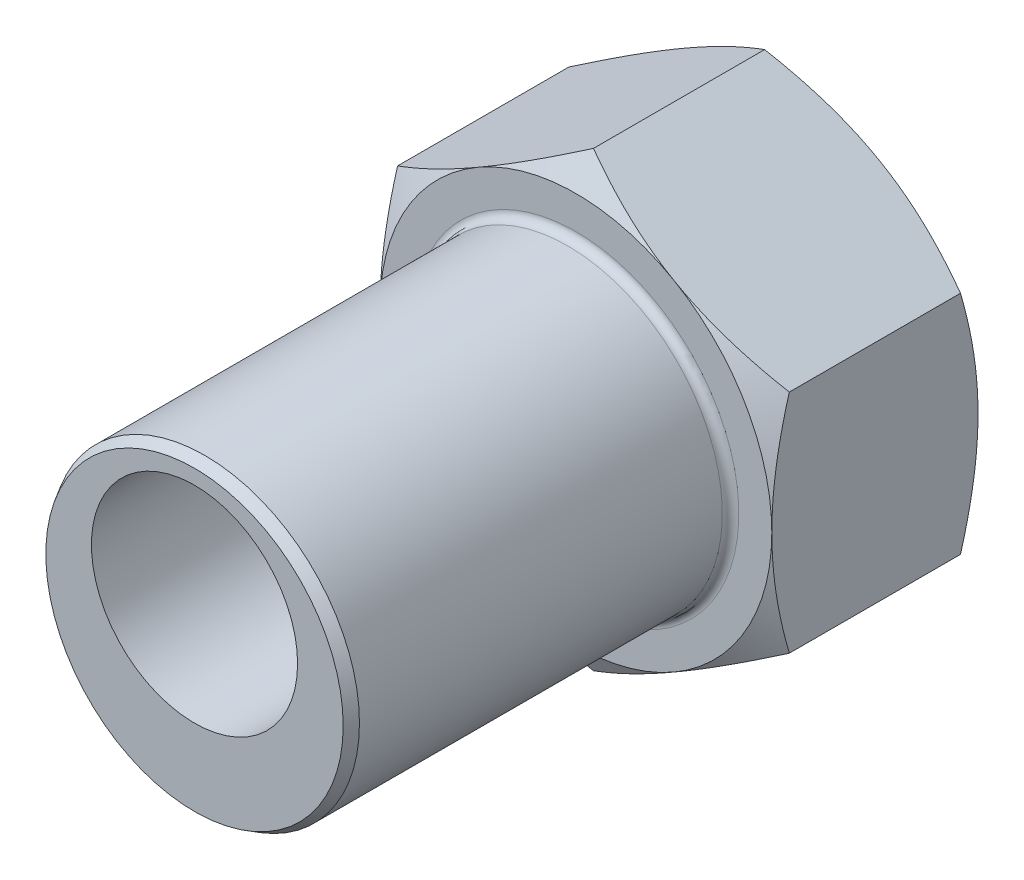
ISO-10303-21;
HEADER;
FILE_DESCRIPTION(('STEP AP214'),'2;1');
FILE_NAME('part.step','',(''),(''),'','','');
FILE_SCHEMA(('AUTOMOTIVE_DESIGN { 1 0 10303 214 1 1 1 1 }'));
ENDSEC;
DATA;
#1=APPLICATION_CONTEXT('core data for automotive mechanical design processes');
#2=APPLICATION_PROTOCOL_DEFINITION('international standard','automotive_design',2000,#1);
#3=PRODUCT_CONTEXT('',#1,'mechanical');
#4=PRODUCT('Part','Part','',(#3));
#5=PRODUCT_RELATED_PRODUCT_CATEGORY('part','',(#4));
#6=PRODUCT_DEFINITION_FORMATION('','',#4);
#7=PRODUCT_DEFINITION_CONTEXT('part definition',#1,'design');
#8=PRODUCT_DEFINITION('design','',#6,#7);
#9=PRODUCT_DEFINITION_SHAPE('','',#8);
#10=(LENGTH_UNIT() NAMED_UNIT(*) SI_UNIT(.MILLI.,.METRE.));
#11=(NAMED_UNIT(*) PLANE_ANGLE_UNIT() SI_UNIT($,.RADIAN.));
#12=(NAMED_UNIT(*) SI_UNIT($,.STERADIAN.) SOLID_ANGLE_UNIT());
#13=UNCERTAINTY_MEASURE_WITH_UNIT(LENGTH_MEASURE(1.E-05),#10,'distance_accuracy_value','');
#14=(GEOMETRIC_REPRESENTATION_CONTEXT(3) GLOBAL_UNCERTAINTY_ASSIGNED_CONTEXT((#13)) GLOBAL_UNIT_ASSIGNED_CONTEXT((#10,
#11,#12)) REPRESENTATION_CONTEXT('',''));
#15=CARTESIAN_POINT('',(0.,0.,0.));
#16=DIRECTION('',(0.,0.,1.));
#17=DIRECTION('',(1.,0.,0.));
#18=AXIS2_PLACEMENT_3D('',#15,#16,#17);
#19=CARTESIAN_POINT('',(0.,9.4696551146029,10.));
#20=DIRECTION('',(0.,0.,-1.));
#21=DIRECTION('',(-1.,0.,0.));
#22=AXIS2_PLACEMENT_3D('',#19,#20,#21);
#23=PLANE('',#22);
#24=CARTESIAN_POINT('',(0.,-1.5,10.));
#25=DIRECTION('',(0.,0.,-1.));
#26=DIRECTION('',(-1.,0.,0.));
#27=AXIS2_PLACEMENT_3D('',#24,#25,#26);
#28=CIRCLE('',#27,7.9);
#29=CARTESIAN_POINT('',(-7.9,-1.5,10.));
#30=VERTEX_POINT('',#29);
#31=EDGE_CURVE('E283',#30,#30,#28,.T.);
#32=ORIENTED_EDGE('',*,*,#31,.T.);
#33=EDGE_LOOP('',(#32));
#34=FACE_BOUND('',#33,.T.);
#35=CARTESIAN_POINT('',(0.,-1.5,10.));
#36=DIRECTION('',(0.,0.,1.));
#37=DIRECTION('',(1.,0.,0.));
#38=AXIS2_PLACEMENT_3D('',#35,#36,#37);
#39=CIRCLE('',#38,9.5);
#40=CARTESIAN_POINT('',(-4.75,6.72724133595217,10.));
#41=VERTEX_POINT('',#40);
#42=CARTESIAN_POINT('',(-9.5,-1.5,10.));
#43=VERTEX_POINT('',#42);
#44=EDGE_CURVE('E331',#41,#43,#39,.T.);
#45=ORIENTED_EDGE('',*,*,#44,.T.);
#46=CARTESIAN_POINT('',(-4.75,-9.72724133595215,10.));
#47=VERTEX_POINT('',#46);
#48=EDGE_CURVE('E327',#43,#47,#39,.T.);
#49=ORIENTED_EDGE('',*,*,#48,.T.);
#50=CARTESIAN_POINT('',(4.75,-9.72724133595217,10.));
#51=VERTEX_POINT('',#50);
#52=EDGE_CURVE('E324',#47,#51,#39,.T.);
#53=ORIENTED_EDGE('',*,*,#52,.T.);
#54=CARTESIAN_POINT('',(9.5,-1.5,10.));
#55=VERTEX_POINT('',#54);
#56=EDGE_CURVE('E322',#51,#55,#39,.T.);
#57=ORIENTED_EDGE('',*,*,#56,.T.);
#58=CARTESIAN_POINT('',(4.75,6.72724133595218,10.));
#59=VERTEX_POINT('',#58);
#60=EDGE_CURVE('E325',#55,#59,#39,.T.);
#61=ORIENTED_EDGE('',*,*,#60,.T.);
#62=EDGE_CURVE('E328',#59,#41,#39,.T.);
#63=ORIENTED_EDGE('',*,*,#62,.T.);
#64=EDGE_LOOP('',(#45,#49,#53,#57,#61,#63));
#65=FACE_BOUND('',#64,.T.);
#66=ADVANCED_FACE('F14',(#34,#65),#23,.F.);
#67=CARTESIAN_POINT('',(-9.5,3.98482755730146,10.));
#68=DIRECTION('',(-0.5,0.866025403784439,0.));
#69=DIRECTION('',(0.866025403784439,0.5,0.));
#70=AXIS2_PLACEMENT_3D('',#67,#68,#69);
#71=PLANE('',#70);
#72=CARTESIAN_POINT('',(-9.5002,3.98471208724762,0.84857244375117));
#73=CARTESIAN_POINT('',(-9.2913692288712,4.10528058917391,0.77897343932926));
#74=CARTESIAN_POINT('',(-9.08175982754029,4.22629863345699,0.71253330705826));
#75=CARTESIAN_POINT('',(-8.66086011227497,4.46930519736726,0.586847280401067));
#76=CARTESIAN_POINT('',(-8.44956926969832,4.59129402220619,0.527603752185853));
#77=CARTESIAN_POINT('',(-7.81229220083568,4.95922610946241,0.361814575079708));
#78=CARTESIAN_POINT('',(-7.38379023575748,5.20662183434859,0.267514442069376));
#79=CARTESIAN_POINT('',(-6.74255666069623,5.57683821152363,0.156938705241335));
#80=CARTESIAN_POINT('',(-6.53174078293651,5.69855281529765,0.125439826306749));
#81=CARTESIAN_POINT('',(-6.10913296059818,5.94254555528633,0.0726182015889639));
#82=CARTESIAN_POINT('',(-5.89734099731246,6.06482370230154,0.0512956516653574));
#83=CARTESIAN_POINT('',(-5.47340378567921,6.3095839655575,0.0193730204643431));
#84=CARTESIAN_POINT('',(-5.26125925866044,6.43206566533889,0.00876019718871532));
#85=CARTESIAN_POINT('',(-4.83677424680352,6.67714220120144,-0.00151746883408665));
#86=CARTESIAN_POINT('',(-4.62443376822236,6.79973703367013,-0.00118264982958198));
#87=CARTESIAN_POINT('',(-4.22745800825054,7.02893109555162,0.00967336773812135));
#88=CARTESIAN_POINT('',(-4.04279470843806,7.1355465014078,0.0188702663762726));
#89=CARTESIAN_POINT('',(-3.67389999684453,7.34852796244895,0.0453653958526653));
#90=CARTESIAN_POINT('',(-3.48966861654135,7.45489399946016,0.0626641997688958));
#91=CARTESIAN_POINT('',(-2.93768832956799,7.7735799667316,0.126304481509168));
#92=CARTESIAN_POINT('',(-2.57091646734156,7.98533580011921,0.184381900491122));
#93=CARTESIAN_POINT('',(-1.83348217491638,8.41109368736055,0.329576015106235));
#94=CARTESIAN_POINT('',(-1.46291385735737,8.62504140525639,0.417308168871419));
#95=CARTESIAN_POINT('',(-0.72730328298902,9.04974636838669,0.616423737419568));
#96=CARTESIAN_POINT('',(-0.362251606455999,9.26050905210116,0.727760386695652));
#97=CARTESIAN_POINT('',(0.000199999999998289,9.46977058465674,0.848572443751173));
#98=B_SPLINE_CURVE_WITH_KNOTS('',3,(#72,#73,#74,#75,#76,#77,#78,#79,#80,#81,#82,#83,#84,#85,#86,
#87,#88,#89,#90,#91,#92,#93,#94,#95,#96,#97),.UNSPECIFIED.,.F.,.F.,(4,2,2,2,2,2,2,2,2,2,2,2,4),
(0.,0.752880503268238,1.50600787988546,3.0154687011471,3.75167336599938,4.48789219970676,
5.22323407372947,5.95855322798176,6.59868084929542,7.23885375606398,8.52010929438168,
9.82978009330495,11.1368800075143),.UNSPECIFIED.);
#99=CARTESIAN_POINT('',(-9.5,3.98482755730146,0.848505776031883));
#100=VERTEX_POINT('',#99);
#101=CARTESIAN_POINT('',(-4.75,6.72724133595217,0.));
#102=VERTEX_POINT('',#101);
#103=EDGE_CURVE('E123',#100,#102,#98,.T.);
#104=ORIENTED_EDGE('',*,*,#103,.F.);
#105=DIRECTION('',(0.,0.,-1.));
#106=VECTOR('',#105,1.);
#107=CARTESIAN_POINT('',(-9.5,3.98482755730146,10.));
#108=LINE('',#107,#106);
#109=CARTESIAN_POINT('',(-9.5,3.98482755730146,9.15149422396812));
#110=VERTEX_POINT('',#109);
#111=EDGE_CURVE('E135',#110,#100,#108,.T.);
#112=ORIENTED_EDGE('',*,*,#111,.F.);
#113=CARTESIAN_POINT('',(-9.5002,3.98471208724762,9.15142755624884));
#114=CARTESIAN_POINT('',(-9.2913692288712,4.10528058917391,9.22102656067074));
#115=CARTESIAN_POINT('',(-9.08175982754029,4.22629863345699,9.28746669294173));
#116=CARTESIAN_POINT('',(-8.66086011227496,4.46930519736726,9.41315271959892));
#117=CARTESIAN_POINT('',(-8.44956926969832,4.59129402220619,9.47239624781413));
#118=CARTESIAN_POINT('',(-7.81229220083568,4.95922610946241,9.63818542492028));
#119=CARTESIAN_POINT('',(-7.38379023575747,5.20662183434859,9.73248555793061));
#120=CARTESIAN_POINT('',(-6.74255666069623,5.57683821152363,9.84306129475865));
#121=CARTESIAN_POINT('',(-6.53174078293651,5.69855281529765,9.87456017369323));
#122=CARTESIAN_POINT('',(-6.10913296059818,5.94254555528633,9.92738179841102));
#123=CARTESIAN_POINT('',(-5.89734099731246,6.06482370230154,9.94870434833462));
#124=CARTESIAN_POINT('',(-5.47340378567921,6.3095839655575,9.98062697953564));
#125=CARTESIAN_POINT('',(-5.26125925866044,6.43206566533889,9.99123980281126));
#126=CARTESIAN_POINT('',(-4.83677424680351,6.67714220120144,10.0015174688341));
#127=CARTESIAN_POINT('',(-4.62443376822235,6.79973703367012,10.0011826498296));
#128=CARTESIAN_POINT('',(-4.22745800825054,7.02893109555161,9.99032663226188));
#129=CARTESIAN_POINT('',(-4.04279470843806,7.13554650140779,9.98112973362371));
#130=CARTESIAN_POINT('',(-3.67389999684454,7.34852796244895,9.95463460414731));
#131=CARTESIAN_POINT('',(-3.48966861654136,7.45489399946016,9.93733580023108));
#132=CARTESIAN_POINT('',(-2.937688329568,7.7735799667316,9.87369551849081));
#133=CARTESIAN_POINT('',(-2.57091646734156,7.98533580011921,9.81561809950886));
#134=CARTESIAN_POINT('',(-1.83348217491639,8.41109368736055,9.67042398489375));
#135=CARTESIAN_POINT('',(-1.46291385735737,8.62504140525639,9.58269183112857));
#136=CARTESIAN_POINT('',(-0.727303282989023,9.04974636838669,9.38357626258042));
#137=CARTESIAN_POINT('',(-0.362251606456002,9.26050905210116,9.27223961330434));
#138=CARTESIAN_POINT('',(0.000199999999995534,9.46977058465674,9.15142755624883));
#139=B_SPLINE_CURVE_WITH_KNOTS('',3,(#113,#114,#115,#116,#117,#118,#119,#120,#121,#122,#123,
#124,#125,#126,#127,#128,#129,#130,#131,#132,#133,#134,#135,#136,#137,#138),.UNSPECIFIED.,.F.,
.F.,(4,2,2,2,2,2,2,2,2,2,2,2,4),(0.,0.752880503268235,1.50600787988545,3.0154687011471,
3.75167336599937,4.48789219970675,5.22323407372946,5.95855322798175,6.59868084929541,
7.23885375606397,8.52010929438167,9.82978009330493,11.1368800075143),.UNSPECIFIED.);
#140=EDGE_CURVE('E211',#110,#41,#139,.T.);
#141=ORIENTED_EDGE('',*,*,#140,.T.);
#142=CARTESIAN_POINT('',(0.,9.4696551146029,9.15149422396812));
#143=VERTEX_POINT('',#142);
#144=EDGE_CURVE('E203',#41,#143,#139,.T.);
#145=ORIENTED_EDGE('',*,*,#144,.T.);
#146=DIRECTION('',(0.,0.,-1.));
#147=VECTOR('',#146,1.);
#148=CARTESIAN_POINT('',(0.,9.4696551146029,10.));
#149=LINE('',#148,#147);
#150=CARTESIAN_POINT('',(0.,9.4696551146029,0.848505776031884));
#151=VERTEX_POINT('',#150);
#152=EDGE_CURVE('E290',#143,#151,#149,.T.);
#153=ORIENTED_EDGE('',*,*,#152,.T.);
#154=EDGE_CURVE('E188',#102,#151,#98,.T.);
#155=ORIENTED_EDGE('',*,*,#154,.F.);
#156=EDGE_LOOP('',(#104,#112,#141,#145,#153,#155));
#157=FACE_BOUND('',#156,.T.);
#158=ADVANCED_FACE('F194',(#157),#71,.T.);
#159=CARTESIAN_POINT('',(-9.5,-6.98482755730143,10.));
#160=DIRECTION('',(-1.,0.,0.));
#161=DIRECTION('',(0.,0.,1.));
#162=AXIS2_PLACEMENT_3D('',#159,#160,#161);
#163=PLANE('',#162);
#164=CARTESIAN_POINT('',(-9.5,-16.2777229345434,4.65800398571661));
#165=CARTESIAN_POINT('',(-9.5,-16.0700824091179,4.55716450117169));
#166=CARTESIAN_POINT('',(-9.5,-15.862199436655,4.45682447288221));
#167=CARTESIAN_POINT('',(-9.5,-15.4458980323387,4.25725635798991));
#168=CARTESIAN_POINT('',(-9.5,-15.2374795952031,4.1580282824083));
#169=CARTESIAN_POINT('',(-9.5,-14.6112903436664,3.86215565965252));
#170=CARTESIAN_POINT('',(-9.5,-14.1926463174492,3.66735228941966));
#171=CARTESIAN_POINT('',(-9.5,-13.3503147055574,3.28278550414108));
#172=CARTESIAN_POINT('',(-9.5,-12.9266120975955,3.09305491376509));
#173=CARTESIAN_POINT('',(-9.5,-12.0758534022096,2.72129513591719));
#174=CARTESIAN_POINT('',(-9.5,-11.6487974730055,2.53926558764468));
#175=CARTESIAN_POINT('',(-9.5,-10.7766752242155,2.1791733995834));
#176=CARTESIAN_POINT('',(-9.5,-10.3314751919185,2.00143283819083));
#177=CARTESIAN_POINT('',(-9.5,-9.43588422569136,1.65929529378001));
#178=CARTESIAN_POINT('',(-9.5,-8.98549271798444,1.49489980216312));
#179=CARTESIAN_POINT('',(-9.5,-8.07962543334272,1.18373616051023));
#180=CARTESIAN_POINT('',(-9.5,-7.62416191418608,1.03693270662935));
#181=CARTESIAN_POINT('',(-9.5,-6.7067175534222,0.765632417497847));
#182=CARTESIAN_POINT('',(-9.5,-6.24473879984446,0.641128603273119));
#183=CARTESIAN_POINT('',(-9.5,-5.31650951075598,0.421048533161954));
#184=CARTESIAN_POINT('',(-9.5,-4.85029775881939,0.32531309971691));
#185=CARTESIAN_POINT('',(-9.5,-4.14669883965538,0.207405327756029));
#186=CARTESIAN_POINT('',(-9.5,-3.91143532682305,0.172383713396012));
#187=CARTESIAN_POINT('',(-9.5,-3.4397237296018,0.111591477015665));
#188=CARTESIAN_POINT('',(-9.5,-3.20327576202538,0.0858199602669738));
#189=CARTESIAN_POINT('',(-9.5,-2.73262023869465,0.044366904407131));
#190=CARTESIAN_POINT('',(-9.5,-2.49842399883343,0.0285573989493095));
#191=CARTESIAN_POINT('',(-9.5,-2.02957271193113,0.00685865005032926));
#192=CARTESIAN_POINT('',(-9.5,-1.79491767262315,0.000969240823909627));
#193=CARTESIAN_POINT('',(-9.5,-1.32556887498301,-0.000748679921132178));
#194=CARTESIAN_POINT('',(-9.5,-1.09087511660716,0.00342281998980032));
#195=CARTESIAN_POINT('',(-9.5,-0.621873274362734,0.0217241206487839));
#196=CARTESIAN_POINT('',(-9.5,-0.3875652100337,0.0358544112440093));
#197=CARTESIAN_POINT('',(-9.5,0.174206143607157,0.0813713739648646));
#198=CARTESIAN_POINT('',(-9.5,0.501300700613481,0.117408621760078));
#199=CARTESIAN_POINT('',(-9.5,1.1530760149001,0.206935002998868));
#200=CARTESIAN_POINT('',(-9.5,1.47775644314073,0.260426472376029));
#201=CARTESIAN_POINT('',(-9.5,2.44779870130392,0.444247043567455));
#202=CARTESIAN_POINT('',(-9.5,3.08880198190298,0.597889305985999));
#203=CARTESIAN_POINT('',(-9.5,4.04730183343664,0.864496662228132));
#204=CARTESIAN_POINT('',(-9.5,4.36976583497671,0.960631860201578));
#205=CARTESIAN_POINT('',(-9.5,5.01156247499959,1.16293379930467));
#206=CARTESIAN_POINT('',(-9.5,5.33089509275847,1.26910060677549));
#207=CARTESIAN_POINT('',(-9.5,5.96652814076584,1.48975853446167));
#208=CARTESIAN_POINT('',(-9.5,6.28282952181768,1.60424694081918));
#209=CARTESIAN_POINT('',(-9.5,6.91280886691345,1.8401963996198));
#210=CARTESIAN_POINT('',(-9.5,7.22648686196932,1.96165736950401));
#211=CARTESIAN_POINT('',(-9.5,7.96760476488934,2.25659741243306));
#212=CARTESIAN_POINT('',(-9.5,8.39402249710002,2.43264024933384));
#213=CARTESIAN_POINT('',(-9.5,9.24321179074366,2.79333613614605));
#214=CARTESIAN_POINT('',(-9.5,9.66598312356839,2.97798972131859));
#215=CARTESIAN_POINT('',(-9.5,10.5085597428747,3.35418008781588));
#216=CARTESIAN_POINT('',(-9.5,10.9283643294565,3.54571843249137));
#217=CARTESIAN_POINT('',(-9.5,11.765406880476,3.93428660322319));
#218=CARTESIAN_POINT('',(-9.5,12.182644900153,4.13131631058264));
#219=CARTESIAN_POINT('',(-9.5,13.0154430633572,4.53005983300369));
#220=CARTESIAN_POINT('',(-9.5,13.4310008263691,4.73177861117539));
#221=CARTESIAN_POINT('',(-9.5,14.2603143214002,5.138886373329));
#222=CARTESIAN_POINT('',(-9.5,14.6740700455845,5.34427537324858));
#223=CARTESIAN_POINT('',(-9.5,15.5000024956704,5.75806601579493));
#224=CARTESIAN_POINT('',(-9.5,15.912179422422,5.96646725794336));
#225=CARTESIAN_POINT('',(-9.5,16.7352371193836,6.38581512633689));
#226=CARTESIAN_POINT('',(-9.5,17.1461178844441,6.5967617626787));
#227=CARTESIAN_POINT('',(-9.5,18.3079453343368,7.19707413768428));
#228=CARTESIAN_POINT('',(-9.5,19.0575919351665,7.58895596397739));
#229=CARTESIAN_POINT('',(-9.5,20.5540884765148,8.37807584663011));
#230=CARTESIAN_POINT('',(-9.5,21.3009383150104,8.77531409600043));
#231=CARTESIAN_POINT('',(-9.5,22.7905576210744,9.57288080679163));
#232=CARTESIAN_POINT('',(-9.5,23.5333326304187,9.97319892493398));
#233=CARTESIAN_POINT('',(-9.5,24.6461763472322,10.5760583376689));
#234=CARTESIAN_POINT('',(-9.5,25.0168942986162,10.7774029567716));
#235=CARTESIAN_POINT('',(-9.5,25.7579404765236,11.1808068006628));
#236=CARTESIAN_POINT('',(-9.5,26.1282687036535,11.3828660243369));
#237=CARTESIAN_POINT('',(-9.5,26.4984241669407,11.5852413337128));
#238=B_SPLINE_CURVE_WITH_KNOTS('',3,(#164,#165,#166,#167,#168,#169,#170,#171,#172,#173,#174,
#175,#176,#177,#178,#179,#180,#181,#182,#183,#184,#185,#186,#187,#188,#189,#190,#191,#192,#193,
#194,#195,#196,#197,#198,#199,#200,#201,#202,#203,#204,#205,#206,#207,#208,#209,#210,#211,#212,
#213,#214,#215,#216,#217,#218,#219,#220,#221,#222,#223,#224,#225,#226,#227,#228,#229,#230,#231,
#232,#233,#234,#235,#236,#237),.UNSPECIFIED.,.F.,.F.,(4,2,2,2,2,2,2,2,2,2,2,2,2,2,2,2,2,2,2,2,2,
2,2,2,2,2,2,2,2,2,2,2,2,2,2,2,4),(0.,0.692493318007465,1.38499349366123,2.77019647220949,
4.16286566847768,5.55546954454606,6.99341101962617,8.43151297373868,9.86667880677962,
11.3013946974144,12.7280194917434,13.4414340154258,14.1547795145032,14.8587642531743,
15.5627372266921,16.266710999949,16.9707194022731,17.9573839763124,18.944180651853,
20.9188522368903,21.9282349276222,22.9376242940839,23.9466859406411,24.9557356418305,
26.3395908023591,27.7235321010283,29.1077896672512,30.4920173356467,31.8777836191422,
33.2635559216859,34.6491456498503,36.0347408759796,38.5723984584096,41.1101477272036,
43.6414852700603,44.9070845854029,46.1726819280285),.UNSPECIFIED.);
#239=CARTESIAN_POINT('',(-9.5,-6.98482755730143,0.848505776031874));
#240=VERTEX_POINT('',#239);
#241=CARTESIAN_POINT('',(-9.5,-1.5,0.));
#242=VERTEX_POINT('',#241);
#243=EDGE_CURVE('E103',#240,#242,#238,.T.);
#244=ORIENTED_EDGE('',*,*,#243,.F.);
#245=DIRECTION('',(0.,0.,-1.));
#246=VECTOR('',#245,1.);
#247=CARTESIAN_POINT('',(-9.5,-6.98482755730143,10.));
#248=LINE('',#247,#246);
#249=CARTESIAN_POINT('',(-9.5,-6.98482755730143,9.15149422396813));
#250=VERTEX_POINT('',#249);
#251=EDGE_CURVE('E287',#250,#240,#248,.T.);
#252=ORIENTED_EDGE('',*,*,#251,.F.);
#253=CARTESIAN_POINT('',(-9.5,-16.3645925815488,5.29977130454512));
#254=CARTESIAN_POINT('',(-9.5,-16.1565800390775,5.40096405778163));
#255=CARTESIAN_POINT('',(-9.5,-15.9483269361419,5.50166208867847));
#256=CARTESIAN_POINT('',(-9.5,-15.5312894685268,5.7019569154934));
#257=CARTESIAN_POINT('',(-9.5,-15.3225050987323,5.80155370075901));
#258=CARTESIAN_POINT('',(-9.5,-14.6952260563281,6.09854991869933));
#259=CARTESIAN_POINT('',(-9.5,-14.2758649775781,6.29412617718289));
#260=CARTESIAN_POINT('',(-9.5,-13.4321602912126,6.68028409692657));
#261=CARTESIAN_POINT('',(-9.5,-13.0078020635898,6.87083389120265));
#262=CARTESIAN_POINT('',(-9.5,-12.155757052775,7.24431289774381));
#263=CARTESIAN_POINT('',(-9.5,-11.7280704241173,7.4272424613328));
#264=CARTESIAN_POINT('',(-9.5,-10.8543627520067,7.78940674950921));
#265=CARTESIAN_POINT('',(-9.5,-10.4082057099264,7.96831514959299));
#266=CARTESIAN_POINT('',(-9.5,-9.5107217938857,8.31290791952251));
#267=CARTESIAN_POINT('',(-9.5,-9.05939435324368,8.47859082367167));
#268=CARTESIAN_POINT('',(-9.5,-8.1516492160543,8.79247849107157));
#269=CARTESIAN_POINT('',(-9.5,-7.69524349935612,8.94071753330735));
#270=CARTESIAN_POINT('',(-9.5,-6.77590201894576,9.21504954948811));
#271=CARTESIAN_POINT('',(-9.5,-6.31296831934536,9.34114936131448));
#272=CARTESIAN_POINT('',(-9.5,-5.38283980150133,9.56455023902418));
#273=CARTESIAN_POINT('',(-9.5,-4.91568487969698,9.66201298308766));
#274=CARTESIAN_POINT('',(-9.5,-4.21059478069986,9.78258119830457));
#275=CARTESIAN_POINT('',(-9.5,-3.97482205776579,9.81850121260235));
#276=CARTESIAN_POINT('',(-9.5,-3.50206045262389,9.88109804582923));
#277=CARTESIAN_POINT('',(-9.5,-3.26507169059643,9.90777576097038));
#278=CARTESIAN_POINT('',(-9.5,-2.79334864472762,9.95101492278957));
#279=CARTESIAN_POINT('',(-9.5,-2.55862631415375,9.96770623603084));
#280=CARTESIAN_POINT('',(-9.5,-2.08868569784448,9.99114150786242));
#281=CARTESIAN_POINT('',(-9.5,-1.85346742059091,9.99788563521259));
#282=CARTESIAN_POINT('',(-9.5,-1.38295660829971,10.0012651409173));
#283=CARTESIAN_POINT('',(-9.5,-1.1476640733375,9.9979005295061));
#284=CARTESIAN_POINT('',(-9.5,-0.677433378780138,9.98114653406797));
#285=CARTESIAN_POINT('',(-9.5,-0.442495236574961,9.96775667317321));
#286=CARTESIAN_POINT('',(-9.5,0.11819800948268,9.92412463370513));
#287=CARTESIAN_POINT('',(-9.5,0.443607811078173,9.88934458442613));
#288=CARTESIAN_POINT('',(-9.5,1.09208262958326,9.80241936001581));
#289=CARTESIAN_POINT('',(-9.5,1.41514733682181,9.75027193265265));
#290=CARTESIAN_POINT('',(-9.5,2.38041610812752,9.57053768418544));
#291=CARTESIAN_POINT('',(-9.5,3.0183501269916,9.41968934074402));
#292=CARTESIAN_POINT('',(-9.5,3.97238526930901,9.15720645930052));
#293=CARTESIAN_POINT('',(-9.5,4.29341124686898,9.06243438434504));
#294=CARTESIAN_POINT('',(-9.5,4.93234764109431,8.86281988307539));
#295=CARTESIAN_POINT('',(-9.5,5.25025803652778,8.75797738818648));
#296=CARTESIAN_POINT('',(-9.5,5.88305856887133,8.53992292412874));
#297=CARTESIAN_POINT('',(-9.5,6.19794960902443,8.42671355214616));
#298=CARTESIAN_POINT('',(-9.5,6.82510786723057,8.19327988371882));
#299=CARTESIAN_POINT('',(-9.5,7.13737512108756,8.07305568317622));
#300=CARTESIAN_POINT('',(-9.5,7.89317942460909,7.77386452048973));
#301=CARTESIAN_POINT('',(-9.5,8.33550469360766,7.59184147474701));
#302=CARTESIAN_POINT('',(-9.5,9.21621435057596,7.21847005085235));
#303=CARTESIAN_POINT('',(-9.5,9.65459845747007,7.02712101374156));
#304=CARTESIAN_POINT('',(-9.5,10.5281897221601,6.63702758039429));
#305=CARTESIAN_POINT('',(-9.5,10.963396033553,6.4382812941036));
#306=CARTESIAN_POINT('',(-9.5,11.8310685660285,6.03493809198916));
#307=CARTESIAN_POINT('',(-9.5,12.2635348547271,5.83034132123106));
#308=CARTESIAN_POINT('',(-9.5,13.1267201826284,5.4161752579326));
#309=CARTESIAN_POINT('',(-9.5,13.5574364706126,5.20660024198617));
#310=CARTESIAN_POINT('',(-9.5,14.4169692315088,4.78359024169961));
#311=CARTESIAN_POINT('',(-9.5,14.8457856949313,4.57015523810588));
#312=CARTESIAN_POINT('',(-9.5,15.7017563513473,4.14013797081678));
#313=CARTESIAN_POINT('',(-9.5,16.1289107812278,3.92355617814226));
#314=CARTESIAN_POINT('',(-9.5,16.9818670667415,3.48774389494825));
#315=CARTESIAN_POINT('',(-9.5,17.4076689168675,3.26851339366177));
#316=CARTESIAN_POINT('',(-9.5,18.6083454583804,2.646367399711));
#317=CARTESIAN_POINT('',(-9.5,19.3818861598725,2.2408776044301));
#318=CARTESIAN_POINT('',(-9.5,20.9261088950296,1.42442843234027));
#319=CARTESIAN_POINT('',(-9.5,21.6967908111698,1.01346883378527));
#320=CARTESIAN_POINT('',(-9.5,23.2338284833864,0.188506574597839));
#321=CARTESIAN_POINT('',(-9.5,24.0001903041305,-0.225484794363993));
#322=CARTESIAN_POINT('',(-9.5,25.1483940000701,-0.848880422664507));
#323=CARTESIAN_POINT('',(-9.5,25.5308940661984,-1.05707418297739));
#324=CARTESIAN_POINT('',(-9.5,26.2954997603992,-1.47418342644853));
#325=CARTESIAN_POINT('',(-9.5,26.6776053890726,-1.68309890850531));
#326=CARTESIAN_POINT('',(-9.5,27.0595365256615,-1.89233299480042));
#327=B_SPLINE_CURVE_WITH_KNOTS('',3,(#253,#254,#255,#256,#257,#258,#259,#260,#261,#262,#263,
#264,#265,#266,#267,#268,#269,#270,#271,#272,#273,#274,#275,#276,#277,#278,#279,#280,#281,#282,
#283,#284,#285,#286,#287,#288,#289,#290,#291,#292,#293,#294,#295,#296,#297,#298,#299,#300,#301,
#302,#303,#304,#305,#306,#307,#308,#309,#310,#311,#312,#313,#314,#315,#316,#317,#318,#319,#320,
#321,#322,#323,#324,#325,#326),.UNSPECIFIED.,.F.,.F.,(4,2,2,2,2,2,2,2,2,2,2,2,2,2,2,2,2,2,2,2,2,
2,2,2,2,2,2,2,2,2,2,2,2,2,2,2,4),(0.,0.693960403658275,1.38792751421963,2.77606041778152,
4.17153114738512,5.56693746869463,7.00884926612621,8.4509206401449,9.89010912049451,
11.3288523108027,12.7593093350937,13.4746364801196,14.1898942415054,14.895636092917,
15.6013659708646,16.3070951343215,17.0128578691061,17.994095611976,18.9754606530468,
20.9392241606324,21.9433057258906,22.9473941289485,23.9511721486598,24.9549364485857,
26.3897305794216,27.8246262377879,29.2598910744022,30.6951203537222,32.1320882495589,
33.5690633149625,35.0058254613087,36.4425934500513,39.0626907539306,41.68289460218,
44.2959843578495,45.6024517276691,46.9089171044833),.UNSPECIFIED.);
#328=EDGE_CURVE('E340',#250,#43,#327,.T.);
#329=ORIENTED_EDGE('',*,*,#328,.T.);
#330=EDGE_CURVE('E224',#43,#110,#327,.T.);
#331=ORIENTED_EDGE('',*,*,#330,.T.);
#332=ORIENTED_EDGE('',*,*,#111,.T.);
#333=EDGE_CURVE('E115',#242,#100,#238,.T.);
#334=ORIENTED_EDGE('',*,*,#333,.F.);
#335=EDGE_LOOP('',(#244,#252,#329,#331,#332,#334));
#336=FACE_BOUND('',#335,.T.);
#337=ADVANCED_FACE('F132',(#336),#163,.T.);
#338=CARTESIAN_POINT('',(0.,-12.4696551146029,10.));
#339=DIRECTION('',(-0.5,-0.866025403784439,0.));
#340=DIRECTION('',(-0.866025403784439,0.5,0.));
#341=AXIS2_PLACEMENT_3D('',#338,#339,#340);
#342=PLANE('',#341);
#343=CARTESIAN_POINT('',(0.000200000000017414,-12.4697705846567,0.848572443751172));
#344=CARTESIAN_POINT('',(-0.20863077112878,-12.3492020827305,0.778973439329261));
#345=CARTESIAN_POINT('',(-0.418240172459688,-12.2281840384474,0.712533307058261));
#346=CARTESIAN_POINT('',(-0.839139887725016,-11.9851774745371,0.586847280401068));
#347=CARTESIAN_POINT('',(-1.05043073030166,-11.8631886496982,0.527603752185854));
#348=CARTESIAN_POINT('',(-1.6877077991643,-11.495256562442,0.361814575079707));
#349=CARTESIAN_POINT('',(-2.11620976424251,-11.2478608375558,0.267514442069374));
#350=CARTESIAN_POINT('',(-2.75744333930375,-10.8776444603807,0.156938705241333));
#351=CARTESIAN_POINT('',(-2.96825921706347,-10.7559298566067,0.125439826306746));
#352=CARTESIAN_POINT('',(-3.3908670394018,-10.511937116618,0.0726182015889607));
#353=CARTESIAN_POINT('',(-3.60265900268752,-10.3896589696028,0.0512956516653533));
#354=CARTESIAN_POINT('',(-4.02659621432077,-10.1448987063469,0.0193730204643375));
#355=CARTESIAN_POINT('',(-4.23874074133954,-10.0224170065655,0.00876019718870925));
#356=CARTESIAN_POINT('',(-4.66322575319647,-9.77734047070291,-0.00151746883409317));
#357=CARTESIAN_POINT('',(-4.87556623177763,-9.65474563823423,-0.00118264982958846));
#358=CARTESIAN_POINT('',(-5.27254199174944,-9.42555157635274,0.00967336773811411));
#359=CARTESIAN_POINT('',(-5.45720529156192,-9.31893617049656,0.0188702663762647));
#360=CARTESIAN_POINT('',(-5.82610000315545,-9.10595470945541,0.0453653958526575));
#361=CARTESIAN_POINT('',(-6.01033138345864,-8.99958867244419,0.0626641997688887));
#362=CARTESIAN_POINT('',(-6.562311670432,-8.68090270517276,0.126304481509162));
#363=CARTESIAN_POINT('',(-6.92908353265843,-8.46914687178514,0.184381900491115));
#364=CARTESIAN_POINT('',(-7.66651782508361,-8.0433889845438,0.329576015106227));
#365=CARTESIAN_POINT('',(-8.03708614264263,-7.82944126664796,0.417308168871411));
#366=CARTESIAN_POINT('',(-8.77269671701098,-7.40473630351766,0.616423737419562));
#367=CARTESIAN_POINT('',(-9.137748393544,-7.19397361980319,0.727760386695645));
#368=CARTESIAN_POINT('',(-9.5002,-6.98471208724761,0.848572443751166));
#369=B_SPLINE_CURVE_WITH_KNOTS('',3,(#343,#344,#345,#346,#347,#348,#349,#350,#351,#352,#353,
#354,#355,#356,#357,#358,#359,#360,#361,#362,#363,#364,#365,#366,#367,#368),.UNSPECIFIED.,.F.,
.F.,(4,2,2,2,2,2,2,2,2,2,2,2,4),(0.,0.752880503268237,1.50600787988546,3.0154687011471,
3.75167336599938,4.48789219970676,5.22323407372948,5.95855322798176,6.59868084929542,
7.23885375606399,8.52010929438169,9.82978009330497,11.1368800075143),.UNSPECIFIED.);
#370=CARTESIAN_POINT('',(0.,-12.4696551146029,0.848505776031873));
#371=VERTEX_POINT('',#370);
#372=CARTESIAN_POINT('',(-4.75,-9.72724133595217,0.));
#373=VERTEX_POINT('',#372);
#374=EDGE_CURVE('E30',#371,#373,#369,.T.);
#375=ORIENTED_EDGE('',*,*,#374,.F.);
#376=DIRECTION('',(0.,0.,-1.));
#377=VECTOR('',#376,1.);
#378=CARTESIAN_POINT('',(0.,-12.4696551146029,10.));
#379=LINE('',#378,#377);
#380=CARTESIAN_POINT('',(0.,-12.4696551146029,9.15149422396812));
#381=VERTEX_POINT('',#380);
#382=EDGE_CURVE('E321',#381,#371,#379,.T.);
#383=ORIENTED_EDGE('',*,*,#382,.F.);
#384=CARTESIAN_POINT('',(0.000200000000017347,-12.4697705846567,9.15142755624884));
#385=CARTESIAN_POINT('',(-0.208630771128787,-12.3492020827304,9.22102656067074));
#386=CARTESIAN_POINT('',(-0.418240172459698,-12.2281840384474,9.28746669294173));
#387=CARTESIAN_POINT('',(-0.839139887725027,-11.9851774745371,9.41315271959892));
#388=CARTESIAN_POINT('',(-1.05043073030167,-11.8631886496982,9.47239624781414));
#389=CARTESIAN_POINT('',(-1.68770779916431,-11.4952565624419,9.63818542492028));
#390=CARTESIAN_POINT('',(-2.11620976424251,-11.2478608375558,9.73248555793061));
#391=CARTESIAN_POINT('',(-2.75744333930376,-10.8776444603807,9.84306129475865));
#392=CARTESIAN_POINT('',(-2.96825921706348,-10.7559298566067,9.87456017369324));
#393=CARTESIAN_POINT('',(-3.3908670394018,-10.511937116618,9.92738179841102));
#394=CARTESIAN_POINT('',(-3.60265900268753,-10.3896589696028,9.94870434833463));
#395=CARTESIAN_POINT('',(-4.02659621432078,-10.1448987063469,9.98062697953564));
#396=CARTESIAN_POINT('',(-4.23874074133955,-10.0224170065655,9.99123980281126));
#397=CARTESIAN_POINT('',(-4.66322575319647,-9.77734047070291,10.0015174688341));
#398=CARTESIAN_POINT('',(-4.87556623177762,-9.65474563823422,10.0011826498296));
#399=CARTESIAN_POINT('',(-5.27254199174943,-9.42555157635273,9.9903266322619));
#400=CARTESIAN_POINT('',(-5.45720529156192,-9.31893617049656,9.98112973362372));
#401=CARTESIAN_POINT('',(-5.82610000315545,-9.10595470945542,9.95463460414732));
#402=CARTESIAN_POINT('',(-6.01033138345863,-8.9995886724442,9.93733580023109));
#403=CARTESIAN_POINT('',(-6.56231167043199,-8.68090270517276,9.87369551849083));
#404=CARTESIAN_POINT('',(-6.92908353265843,-8.46914687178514,9.81561809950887));
#405=CARTESIAN_POINT('',(-7.66651782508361,-8.04338898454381,9.67042398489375));
#406=CARTESIAN_POINT('',(-8.03708614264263,-7.82944126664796,9.58269183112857));
#407=CARTESIAN_POINT('',(-8.77269671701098,-7.40473630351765,9.38357626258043));
#408=CARTESIAN_POINT('',(-9.137748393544,-7.19397361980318,9.27223961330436));
#409=CARTESIAN_POINT('',(-9.5002,-6.98471208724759,9.15142755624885));
#410=B_SPLINE_CURVE_WITH_KNOTS('',3,(#384,#385,#386,#387,#388,#389,#390,#391,#392,#393,#394,
#395,#396,#397,#398,#399,#400,#401,#402,#403,#404,#405,#406,#407,#408,#409),.UNSPECIFIED.,.F.,
.F.,(4,2,2,2,2,2,2,2,2,2,2,2,4),(0.,0.752880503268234,1.50600787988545,3.01546870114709,
3.75167336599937,4.48789219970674,5.22323407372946,5.95855322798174,6.5986808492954,
7.23885375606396,8.52010929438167,9.82978009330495,11.1368800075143),.UNSPECIFIED.);
#411=EDGE_CURVE('E348',#381,#47,#410,.T.);
#412=ORIENTED_EDGE('',*,*,#411,.T.);
#413=EDGE_CURVE('E342',#47,#250,#410,.T.);
#414=ORIENTED_EDGE('',*,*,#413,.T.);
#415=ORIENTED_EDGE('',*,*,#251,.T.);
#416=EDGE_CURVE('E109',#373,#240,#369,.T.);
#417=ORIENTED_EDGE('',*,*,#416,.F.);
#418=EDGE_LOOP('',(#375,#383,#412,#414,#415,#417));
#419=FACE_BOUND('',#418,.T.);
#420=ADVANCED_FACE('F236',(#419),#342,.T.);
#421=CARTESIAN_POINT('',(9.5,-6.98482755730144,10.));
#422=DIRECTION('',(0.5,-0.866025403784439,0.));
#423=DIRECTION('',(-0.866025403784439,-0.5,0.));
#424=AXIS2_PLACEMENT_3D('',#421,#422,#423);
#425=PLANE('',#424);
#426=CARTESIAN_POINT('',(9.5002,-6.9847120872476,0.848572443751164));
#427=CARTESIAN_POINT('',(9.2913692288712,-7.10528058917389,0.778973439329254));
#428=CARTESIAN_POINT('',(9.08175982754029,-7.22629863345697,0.712533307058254));
#429=CARTESIAN_POINT('',(8.66086011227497,-7.46930519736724,0.586847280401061));
#430=CARTESIAN_POINT('',(8.44956926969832,-7.59129402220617,0.527603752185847));
#431=CARTESIAN_POINT('',(7.81229220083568,-7.95922610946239,0.3618145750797));
#432=CARTESIAN_POINT('',(7.38379023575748,-8.20662183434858,0.267514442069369));
#433=CARTESIAN_POINT('',(6.74255666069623,-8.57683821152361,0.156938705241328));
#434=CARTESIAN_POINT('',(6.53174078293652,-8.69855281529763,0.125439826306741));
#435=CARTESIAN_POINT('',(6.10913296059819,-8.9425455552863,0.0726182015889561));
#436=CARTESIAN_POINT('',(5.89734099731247,-9.06482370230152,0.0512956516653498));
#437=CARTESIAN_POINT('',(5.47340378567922,-9.30958396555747,0.0193730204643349));
#438=CARTESIAN_POINT('',(5.26125925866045,-9.43206566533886,0.00876019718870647));
#439=CARTESIAN_POINT('',(4.83677424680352,-9.67714220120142,-0.00151746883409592));
#440=CARTESIAN_POINT('',(4.62443376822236,-9.7997370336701,-0.00118264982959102));
#441=CARTESIAN_POINT('',(4.22745800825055,-10.0289310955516,0.0096733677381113));
#442=CARTESIAN_POINT('',(4.04279470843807,-10.1355465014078,0.0188702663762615));
#443=CARTESIAN_POINT('',(3.67389999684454,-10.3485279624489,0.0453653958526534));
#444=CARTESIAN_POINT('',(3.48966861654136,-10.4548939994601,0.0626641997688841));
#445=CARTESIAN_POINT('',(2.937688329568,-10.7735799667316,0.126304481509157));
#446=CARTESIAN_POINT('',(2.57091646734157,-10.9853358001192,0.184381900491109));
#447=CARTESIAN_POINT('',(1.8334821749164,-11.4110936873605,0.32957601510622));
#448=CARTESIAN_POINT('',(1.46291385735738,-11.6250414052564,0.417308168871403));
#449=CARTESIAN_POINT('',(0.727303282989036,-12.0497463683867,0.616423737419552));
#450=CARTESIAN_POINT('',(0.362251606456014,-12.2605090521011,0.727760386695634));
#451=CARTESIAN_POINT('',(-0.000199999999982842,-12.4697705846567,0.848572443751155));
#452=B_SPLINE_CURVE_WITH_KNOTS('',3,(#426,#427,#428,#429,#430,#431,#432,#433,#434,#435,#436,
#437,#438,#439,#440,#441,#442,#443,#444,#445,#446,#447,#448,#449,#450,#451),.UNSPECIFIED.,.F.,
.F.,(4,2,2,2,2,2,2,2,2,2,2,2,4),(0.,0.752880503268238,1.50600787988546,3.0154687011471,
3.75167336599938,4.48789219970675,5.22323407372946,5.95855322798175,6.5986808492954,
7.23885375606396,8.52010929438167,9.82978009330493,11.1368800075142),.UNSPECIFIED.);
#453=CARTESIAN_POINT('',(9.5,-6.98482755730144,0.848505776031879));
#454=VERTEX_POINT('',#453);
#455=CARTESIAN_POINT('',(4.75,-9.72724133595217,0.));
#456=VERTEX_POINT('',#455);
#457=EDGE_CURVE('E37',#454,#456,#452,.T.);
#458=ORIENTED_EDGE('',*,*,#457,.F.);
#459=DIRECTION('',(0.,0.,-1.));
#460=VECTOR('',#459,1.);
#461=CARTESIAN_POINT('',(9.5,-6.98482755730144,10.));
#462=LINE('',#461,#460);
#463=CARTESIAN_POINT('',(9.5,-6.98482755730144,9.15149422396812));
#464=VERTEX_POINT('',#463);
#465=EDGE_CURVE('E363',#464,#454,#462,.T.);
#466=ORIENTED_EDGE('',*,*,#465,.F.);
#467=CARTESIAN_POINT('',(9.5002,-6.9847120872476,9.15142755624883));
#468=CARTESIAN_POINT('',(9.2913692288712,-7.10528058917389,9.22102656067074));
#469=CARTESIAN_POINT('',(9.0817598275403,-7.22629863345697,9.28746669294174));
#470=CARTESIAN_POINT('',(8.66086011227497,-7.46930519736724,9.41315271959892));
#471=CARTESIAN_POINT('',(8.44956926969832,-7.59129402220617,9.47239624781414));
#472=CARTESIAN_POINT('',(7.81229220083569,-7.95922610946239,9.63818542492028));
#473=CARTESIAN_POINT('',(7.38379023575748,-8.20662183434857,9.73248555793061));
#474=CARTESIAN_POINT('',(6.74255666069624,-8.57683821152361,9.84306129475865));
#475=CARTESIAN_POINT('',(6.53174078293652,-8.69855281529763,9.87456017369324));
#476=CARTESIAN_POINT('',(6.10913296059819,-8.9425455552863,9.92738179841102));
#477=CARTESIAN_POINT('',(5.89734099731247,-9.06482370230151,9.94870434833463));
#478=CARTESIAN_POINT('',(5.47340378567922,-9.30958396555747,9.98062697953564));
#479=CARTESIAN_POINT('',(5.26125925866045,-9.43206566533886,9.99123980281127));
#480=CARTESIAN_POINT('',(4.83677424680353,-9.67714220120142,10.0015174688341));
#481=CARTESIAN_POINT('',(4.62443376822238,-9.79973703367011,10.0011826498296));
#482=CARTESIAN_POINT('',(4.22745800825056,-10.0289310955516,9.99032663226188));
#483=CARTESIAN_POINT('',(4.04279470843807,-10.1355465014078,9.98112973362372));
#484=CARTESIAN_POINT('',(3.67389999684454,-10.3485279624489,9.95463460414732));
#485=CARTESIAN_POINT('',(3.48966861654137,-10.4548939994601,9.93733580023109));
#486=CARTESIAN_POINT('',(2.93768832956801,-10.7735799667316,9.87369551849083));
#487=CARTESIAN_POINT('',(2.57091646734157,-10.9853358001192,9.81561809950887));
#488=CARTESIAN_POINT('',(1.8334821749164,-11.4110936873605,9.67042398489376));
#489=CARTESIAN_POINT('',(1.46291385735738,-11.6250414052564,9.58269183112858));
#490=CARTESIAN_POINT('',(0.727303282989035,-12.0497463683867,9.38357626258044));
#491=CARTESIAN_POINT('',(0.362251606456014,-12.2605090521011,9.27223961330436));
#492=CARTESIAN_POINT('',(-0.000199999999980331,-12.4697705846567,9.15142755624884));
#493=B_SPLINE_CURVE_WITH_KNOTS('',3,(#467,#468,#469,#470,#471,#472,#473,#474,#475,#476,#477,
#478,#479,#480,#481,#482,#483,#484,#485,#486,#487,#488,#489,#490,#491,#492),.UNSPECIFIED.,.F.,
.F.,(4,2,2,2,2,2,2,2,2,2,2,2,4),(0.,0.752880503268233,1.50600787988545,3.01546870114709,
3.75167336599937,4.48789219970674,5.22323407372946,5.95855322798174,6.5986808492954,
7.23885375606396,8.52010929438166,9.82978009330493,11.1368800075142),.UNSPECIFIED.);
#494=EDGE_CURVE('E217',#464,#51,#493,.T.);
#495=ORIENTED_EDGE('',*,*,#494,.T.);
#496=EDGE_CURVE('E226',#51,#381,#493,.T.);
#497=ORIENTED_EDGE('',*,*,#496,.T.);
#498=ORIENTED_EDGE('',*,*,#382,.T.);
#499=EDGE_CURVE('E114',#456,#371,#452,.T.);
#500=ORIENTED_EDGE('',*,*,#499,.F.);
#501=EDGE_LOOP('',(#458,#466,#495,#497,#498,#500));
#502=FACE_BOUND('',#501,.T.);
#503=ADVANCED_FACE('F232',(#502),#425,.T.);
#504=CARTESIAN_POINT('',(9.5,3.98482755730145,10.));
#505=DIRECTION('',(1.,0.,0.));
#506=DIRECTION('',(0.,-1.,0.));
#507=AXIS2_PLACEMENT_3D('',#504,#505,#506);
#508=PLANE('',#507);
#509=CARTESIAN_POINT('',(9.5,-16.277722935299,4.6580039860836));
#510=CARTESIAN_POINT('',(9.50000000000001,-16.0700824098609,4.55716450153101));
#511=CARTESIAN_POINT('',(9.50000000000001,-15.8621994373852,4.45682447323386));
#512=CARTESIAN_POINT('',(9.50000000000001,-15.4458980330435,4.25725635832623));
#513=CARTESIAN_POINT('',(9.50000000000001,-15.2374795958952,4.15802828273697));
#514=CARTESIAN_POINT('',(9.50000000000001,-14.6112903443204,3.86215565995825));
#515=CARTESIAN_POINT('',(9.50000000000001,-14.1926463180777,3.66735228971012));
#516=CARTESIAN_POINT('',(9.50000000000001,-13.3503147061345,3.28278550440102));
#517=CARTESIAN_POINT('',(9.50000000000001,-12.9266120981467,3.09305491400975));
#518=CARTESIAN_POINT('',(9.50000000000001,-12.0758534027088,2.72129513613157));
#519=CARTESIAN_POINT('',(9.50000000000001,-11.6487974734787,2.53926558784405));
#520=CARTESIAN_POINT('',(9.50000000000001,-10.7766752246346,2.17917339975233));
#521=CARTESIAN_POINT('',(9.50000000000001,-10.3314751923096,2.00143283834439));
#522=CARTESIAN_POINT('',(9.50000000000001,-9.43588422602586,1.65929529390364));
#523=CARTESIAN_POINT('',(9.50000000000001,-8.98549271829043,1.4948998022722));
#524=CARTESIAN_POINT('',(9.50000000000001,-8.07962543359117,1.18373616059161));
#525=CARTESIAN_POINT('',(9.50000000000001,-7.62416191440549,1.03693270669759));
#526=CARTESIAN_POINT('',(9.5,-6.70671755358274,0.765632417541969));
#527=CARTESIAN_POINT('',(9.5,-6.24473879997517,0.641128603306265));
#528=CARTESIAN_POINT('',(9.5,-5.31650951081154,0.421048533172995));
#529=CARTESIAN_POINT('',(9.5,-4.85029775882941,0.325313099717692));
#530=CARTESIAN_POINT('',(9.5,-4.14669883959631,0.207405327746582));
#531=CARTESIAN_POINT('',(9.5,-3.91143532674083,0.172383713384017));
#532=CARTESIAN_POINT('',(9.5,-3.43972372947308,0.111591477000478));
#533=CARTESIAN_POINT('',(9.5,-3.20327576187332,0.0858199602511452));
#534=CARTESIAN_POINT('',(9.5,-2.73262023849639,0.0443669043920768));
#535=CARTESIAN_POINT('',(9.5,-2.49842399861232,0.0285573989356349));
#536=CARTESIAN_POINT('',(9.5,-2.02957271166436,0.00685865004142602));
#537=CARTESIAN_POINT('',(9.5,-1.79491767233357,0.000969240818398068));
#538=CARTESIAN_POINT('',(9.5,-1.325568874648,-0.000748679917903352));
#539=CARTESIAN_POINT('',(9.5,-1.09087511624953,0.0034228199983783));
#540=CARTESIAN_POINT('',(9.5,-0.621873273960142,0.0217241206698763));
#541=CARTESIAN_POINT('',(9.5,-0.38756520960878,0.035854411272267));
#542=CARTESIAN_POINT('',(9.5,0.174206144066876,0.0813713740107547));
#543=CARTESIAN_POINT('',(9.5,0.501300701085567,0.117408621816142));
#544=CARTESIAN_POINT('',(9.5,1.15307601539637,0.206935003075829));
#545=CARTESIAN_POINT('',(9.5,1.47775644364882,0.260426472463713));
#546=CARTESIAN_POINT('',(9.5,2.44779870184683,0.444247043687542));
#547=CARTESIAN_POINT('',(9.5,3.08880198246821,0.597889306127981));
#548=CARTESIAN_POINT('',(9.5,4.04730183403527,0.864496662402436));
#549=CARTESIAN_POINT('',(9.5,4.36976583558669,0.960631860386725));
#550=CARTESIAN_POINT('',(9.5,5.01156247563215,1.16293379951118));
#551=CARTESIAN_POINT('',(9.5,5.33089509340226,1.26910060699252));
#552=CARTESIAN_POINT('',(9.5,5.96652814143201,1.48975853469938));
#553=CARTESIAN_POINT('',(9.5,6.282829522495,1.60424694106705));
#554=CARTESIAN_POINT('',(9.5,6.91280886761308,1.84019639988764));
#555=CARTESIAN_POINT('',(9.5,7.2264868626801,1.96165736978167));
#556=CARTESIAN_POINT('',(9.5,7.96760476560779,2.25659741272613));
#557=CARTESIAN_POINT('',(9.5,8.39402249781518,2.43264024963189));
#558=CARTESIAN_POINT('',(9.5,9.24321179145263,2.79333613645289));
#559=CARTESIAN_POINT('',(9.5,9.66598312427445,2.97798972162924));
#560=CARTESIAN_POINT('',(9.5,10.5085597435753,3.35418008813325));
#561=CARTESIAN_POINT('',(9.5,10.9283643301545,3.54571843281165));
#562=CARTESIAN_POINT('',(9.5,11.765406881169,3.93428660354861));
#563=CARTESIAN_POINT('',(9.5,12.1826449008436,4.13131631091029));
#564=CARTESIAN_POINT('',(9.5,13.0154430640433,4.53005983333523));
#565=CARTESIAN_POINT('',(9.49999999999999,13.431000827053,4.73177861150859));
#566=CARTESIAN_POINT('',(9.49999999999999,14.2603143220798,5.13888637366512));
#567=CARTESIAN_POINT('',(9.49999999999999,14.674070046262,5.34427537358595));
#568=CARTESIAN_POINT('',(9.49999999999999,15.5000024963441,5.75806601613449));
#569=CARTESIAN_POINT('',(9.49999999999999,15.9121794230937,5.96646725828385));
#570=CARTESIAN_POINT('',(9.49999999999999,16.7352371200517,6.38581512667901));
#571=CARTESIAN_POINT('',(9.49999999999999,17.1461178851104,6.5967617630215));
#572=CARTESIAN_POINT('',(9.49999999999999,18.3079453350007,7.19707413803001));
#573=CARTESIAN_POINT('',(9.49999999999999,19.0575919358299,7.58895596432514));
#574=CARTESIAN_POINT('',(9.49999999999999,20.5540884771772,8.37807584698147));
#575=CARTESIAN_POINT('',(9.49999999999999,21.3009383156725,8.77531409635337));
#576=CARTESIAN_POINT('',(9.49999999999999,22.7905576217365,9.57288080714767));
#577=CARTESIAN_POINT('',(9.49999999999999,23.5333326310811,9.97319892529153));
#578=CARTESIAN_POINT('',(9.49999999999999,24.6461763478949,10.5760583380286));
#579=CARTESIAN_POINT('',(9.49999999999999,25.0168942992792,10.777402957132));
#580=CARTESIAN_POINT('',(9.49999999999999,25.7579404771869,11.1808068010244));
#581=CARTESIAN_POINT('',(9.49999999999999,26.1282687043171,11.3828660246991));
#582=CARTESIAN_POINT('',(9.5,26.4984241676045,11.5852413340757));
#583=B_SPLINE_CURVE_WITH_KNOTS('',3,(#509,#510,#511,#512,#513,#514,#515,#516,#517,#518,#519,
#520,#521,#522,#523,#524,#525,#526,#527,#528,#529,#530,#531,#532,#533,#534,#535,#536,#537,#538,
#539,#540,#541,#542,#543,#544,#545,#546,#547,#548,#549,#550,#551,#552,#553,#554,#555,#556,#557,
#558,#559,#560,#561,#562,#563,#564,#565,#566,#567,#568,#569,#570,#571,#572,#573,#574,#575,#576,
#577,#578,#579,#580,#581,#582),.UNSPECIFIED.,.F.,.F.,(4,2,2,2,2,2,2,2,2,2,2,2,2,2,2,2,2,2,2,2,2,
2,2,2,2,2,2,2,2,2,2,2,2,2,2,2,4),(0.,0.692493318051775,1.38499349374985,2.77019647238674,
4.16286566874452,5.5554695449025,6.99341102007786,8.43151297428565,9.86667880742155,
11.3013946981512,12.7280194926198,13.441434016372,14.1547795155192,14.8587642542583,
15.5627372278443,16.2667110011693,16.9707194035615,17.957383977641,18.9441806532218,
20.9188522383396,21.9282349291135,22.9376242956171,23.9466859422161,24.9557356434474,
26.3395908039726,27.7235321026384,29.1077896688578,30.4920173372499,31.8777836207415,
33.2635559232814,34.649145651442,36.0347408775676,38.5723984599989,41.1101477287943,
43.6414852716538,44.9070845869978,46.1726819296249),.UNSPECIFIED.);
#584=CARTESIAN_POINT('',(9.5,3.98482755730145,0.848505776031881));
#585=VERTEX_POINT('',#584);
#586=CARTESIAN_POINT('',(9.5,-1.5,0.));
#587=VERTEX_POINT('',#586);
#588=EDGE_CURVE('E181',#585,#587,#583,.F.);
#589=ORIENTED_EDGE('',*,*,#588,.F.);
#590=DIRECTION('',(0.,0.,-1.));
#591=VECTOR('',#590,1.);
#592=CARTESIAN_POINT('',(9.5,3.98482755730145,10.));
#593=LINE('',#592,#591);
#594=CARTESIAN_POINT('',(9.5,3.98482755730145,9.15149422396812));
#595=VERTEX_POINT('',#594);
#596=EDGE_CURVE('E364',#595,#585,#593,.T.);
#597=ORIENTED_EDGE('',*,*,#596,.F.);
#598=CARTESIAN_POINT('',(9.5,-16.3645925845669,5.29977130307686));
#599=CARTESIAN_POINT('',(9.50000000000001,-16.1565800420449,5.40096405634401));
#600=CARTESIAN_POINT('',(9.50000000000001,-15.9483269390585,5.50166208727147));
#601=CARTESIAN_POINT('',(9.50000000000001,-15.5312894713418,5.70195691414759));
#602=CARTESIAN_POINT('',(9.50000000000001,-15.3225051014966,5.80155369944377));
#603=CARTESIAN_POINT('',(9.50000000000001,-14.6952260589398,6.09854991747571));
#604=CARTESIAN_POINT('',(9.50000000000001,-14.2758649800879,6.29412617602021));
#605=CARTESIAN_POINT('',(9.50000000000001,-13.4321602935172,6.68028409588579));
#606=CARTESIAN_POINT('',(9.50000000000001,-13.007802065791,6.87083389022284));
#607=CARTESIAN_POINT('',(9.50000000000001,-12.1557570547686,7.24431289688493));
#608=CARTESIAN_POINT('',(9.50000000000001,-11.7280704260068,7.42724246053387));
#609=CARTESIAN_POINT('',(9.50000000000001,-10.8543627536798,7.78940674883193));
#610=CARTESIAN_POINT('',(9.50000000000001,-10.4082057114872,7.96831514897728));
#611=CARTESIAN_POINT('',(9.50000000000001,-9.51072179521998,8.31290791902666));
#612=CARTESIAN_POINT('',(9.50000000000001,-9.05939435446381,8.4785908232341));
#613=CARTESIAN_POINT('',(9.50000000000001,-8.15164921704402,8.79247849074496));
#614=CARTESIAN_POINT('',(9.50000000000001,-7.69524350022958,8.94071753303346));
#615=CARTESIAN_POINT('',(9.5,-6.77590201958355,9.21504954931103));
#616=CARTESIAN_POINT('',(9.5,-6.31296831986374,9.34114936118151));
#617=CARTESIAN_POINT('',(9.5,-5.38283980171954,9.56455023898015));
#618=CARTESIAN_POINT('',(9.5,-4.91568487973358,9.66201298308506));
#619=CARTESIAN_POINT('',(9.5,-4.21059478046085,9.78258119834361));
#620=CARTESIAN_POINT('',(9.5,-3.97482205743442,9.81850121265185));
#621=CARTESIAN_POINT('',(9.5,-3.502060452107,9.88109804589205));
#622=CARTESIAN_POINT('',(9.5,-3.26507168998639,9.90777576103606));
#623=CARTESIAN_POINT('',(9.5,-2.79334864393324,9.95101492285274));
#624=CARTESIAN_POINT('',(9.5,-2.55862631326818,9.96770623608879));
#625=CARTESIAN_POINT('',(9.5,-2.0886856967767,9.99114150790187));
#626=CARTESIAN_POINT('',(9.5,-1.85346741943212,9.99788563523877));
#627=CARTESIAN_POINT('',(9.5,-1.38295660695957,10.0012651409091));
#628=CARTESIAN_POINT('',(9.5,-1.14766407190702,9.99790052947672));
#629=CARTESIAN_POINT('',(9.5,-0.677433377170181,9.981146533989));
#630=CARTESIAN_POINT('',(9.5,-0.442495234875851,9.96775667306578));
#631=CARTESIAN_POINT('',(9.5,0.118198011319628,9.92412463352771));
#632=CARTESIAN_POINT('',(9.5,0.443607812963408,9.88934458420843));
#633=CARTESIAN_POINT('',(9.5,1.09208263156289,9.80241935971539));
#634=CARTESIAN_POINT('',(9.5,1.41514733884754,9.75027193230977));
#635=CARTESIAN_POINT('',(9.5,2.38041611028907,9.57053768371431));
#636=CARTESIAN_POINT('',(9.5,3.01835012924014,9.41968934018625));
#637=CARTESIAN_POINT('',(9.5,3.97238527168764,9.15720645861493));
#638=CARTESIAN_POINT('',(9.5,4.29341124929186,9.06243438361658));
#639=CARTESIAN_POINT('',(9.5,4.9323476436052,8.86281988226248));
#640=CARTESIAN_POINT('',(9.5,5.25025803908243,8.757977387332));
#641=CARTESIAN_POINT('',(9.5,5.88305857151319,8.53992292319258));
#642=CARTESIAN_POINT('',(9.5,6.19794961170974,8.42671355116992));
#643=CARTESIAN_POINT('',(9.5,6.82510787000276,8.19327988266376));
#644=CARTESIAN_POINT('',(9.5,7.1373751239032,8.07305568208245));
#645=CARTESIAN_POINT('',(9.5,7.89317942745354,7.77386451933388));
#646=CARTESIAN_POINT('',(9.5,8.33550469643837,7.59184147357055));
#647=CARTESIAN_POINT('',(9.5,9.21621435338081,7.21847004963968));
#648=CARTESIAN_POINT('',(9.5,9.65459846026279,7.02712101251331));
#649=CARTESIAN_POINT('',(9.5,10.5281897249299,6.63702757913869));
#650=CARTESIAN_POINT('',(9.5,10.9633960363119,6.43828129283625));
#651=CARTESIAN_POINT('',(9.5,11.8310685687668,6.03493809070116));
#652=CARTESIAN_POINT('',(9.5,12.2635348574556,5.83034131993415));
#653=CARTESIAN_POINT('',(9.5,13.1267201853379,5.41617525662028));
#654=CARTESIAN_POINT('',(9.49999999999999,13.5574364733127,5.20660024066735));
#655=CARTESIAN_POINT('',(9.49999999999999,14.4169692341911,4.78359024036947));
#656=CARTESIAN_POINT('',(9.49999999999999,14.8457856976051,4.57015523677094));
#657=CARTESIAN_POINT('',(9.49999999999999,15.7017563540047,4.14013796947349));
#658=CARTESIAN_POINT('',(9.49999999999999,16.1289107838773,3.92355617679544));
#659=CARTESIAN_POINT('',(9.49999999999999,16.9818670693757,3.48774389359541));
#660=CARTESIAN_POINT('',(9.49999999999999,17.4076689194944,3.26851339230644));
#661=CARTESIAN_POINT('',(9.49999999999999,18.6083454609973,2.64636739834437));
#662=CARTESIAN_POINT('',(9.49999999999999,19.3818861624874,2.24087760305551));
#663=CARTESIAN_POINT('',(9.49999999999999,20.9261088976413,1.42442843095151));
#664=CARTESIAN_POINT('',(9.49999999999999,21.6967908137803,1.01346883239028));
#665=CARTESIAN_POINT('',(9.49999999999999,23.233828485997,0.188506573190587));
#666=CARTESIAN_POINT('',(9.49999999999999,24.0001903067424,-0.225484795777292));
#667=CARTESIAN_POINT('',(9.49999999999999,25.1483940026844,-0.848880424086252));
#668=CARTESIAN_POINT('',(9.49999999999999,25.5308940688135,-1.05707418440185));
#669=CARTESIAN_POINT('',(9.49999999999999,26.2954997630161,-1.47418342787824));
#670=CARTESIAN_POINT('',(9.49999999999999,26.6776053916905,-1.68309890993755));
#671=CARTESIAN_POINT('',(9.5,27.0595365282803,-1.8923329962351));
#672=B_SPLINE_CURVE_WITH_KNOTS('',3,(#598,#599,#600,#601,#602,#603,#604,#605,#606,#607,#608,
#609,#610,#611,#612,#613,#614,#615,#616,#617,#618,#619,#620,#621,#622,#623,#624,#625,#626,#627,
#628,#629,#630,#631,#632,#633,#634,#635,#636,#637,#638,#639,#640,#641,#642,#643,#644,#645,#646,
#647,#648,#649,#650,#651,#652,#653,#654,#655,#656,#657,#658,#659,#660,#661,#662,#663,#664,#665,
#666,#667,#668,#669,#670,#671),.UNSPECIFIED.,.F.,.F.,(4,2,2,2,2,2,2,2,2,2,2,2,2,2,2,2,2,2,2,2,2,
2,2,2,2,2,2,2,2,2,2,2,2,2,2,2,4),(0.,0.693960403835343,1.38792751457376,2.77606041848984,
4.1715311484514,5.56693747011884,7.00884926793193,8.45092064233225,9.89010912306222,
11.3288523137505,12.7593093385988,13.4746364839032,14.1898942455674,14.8956360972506,
15.6013659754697,16.3070951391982,17.0128578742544,17.9940956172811,18.9754606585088,
20.9392241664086,21.9433057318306,22.9473941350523,23.951172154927,24.9549364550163,
26.3897305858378,27.8246262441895,29.2598910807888,30.695120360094,32.1320882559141,
33.5690633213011,35.005825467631,36.4425934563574,39.0626907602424,41.6828946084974,
44.2959843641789,45.6024517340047,46.9089171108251),.UNSPECIFIED.);
#673=EDGE_CURVE('E212',#595,#55,#672,.F.);
#674=ORIENTED_EDGE('',*,*,#673,.T.);
#675=EDGE_CURVE('E225',#55,#464,#672,.F.);
#676=ORIENTED_EDGE('',*,*,#675,.T.);
#677=ORIENTED_EDGE('',*,*,#465,.T.);
#678=EDGE_CURVE('E136',#587,#454,#583,.F.);
#679=ORIENTED_EDGE('',*,*,#678,.F.);
#680=EDGE_LOOP('',(#589,#597,#674,#676,#677,#679));
#681=FACE_BOUND('',#680,.T.);
#682=ADVANCED_FACE('F235',(#681),#508,.T.);
#683=CARTESIAN_POINT('',(0.,9.4696551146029,10.));
#684=DIRECTION('',(0.5,0.866025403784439,0.));
#685=DIRECTION('',(0.866025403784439,-0.5,0.));
#686=AXIS2_PLACEMENT_3D('',#683,#684,#685);
#687=PLANE('',#686);
#688=CARTESIAN_POINT('',(-0.000200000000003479,9.46977058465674,0.848572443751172));
#689=CARTESIAN_POINT('',(0.208630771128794,9.34920208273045,0.778973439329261));
#690=CARTESIAN_POINT('',(0.418240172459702,9.22818403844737,0.71253330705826));
#691=CARTESIAN_POINT('',(0.83913988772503,8.9851774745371,0.586847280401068));
#692=CARTESIAN_POINT('',(1.05043073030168,8.86318864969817,0.527603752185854));
#693=CARTESIAN_POINT('',(1.68770779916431,8.49525656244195,0.361814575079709));
#694=CARTESIAN_POINT('',(2.11620976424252,8.24786083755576,0.267514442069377));
#695=CARTESIAN_POINT('',(2.75744333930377,7.87764446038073,0.156938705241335));
#696=CARTESIAN_POINT('',(2.96825921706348,7.75592985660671,0.125439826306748));
#697=CARTESIAN_POINT('',(3.39086703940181,7.51193711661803,0.0726182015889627));
#698=CARTESIAN_POINT('',(3.60265900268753,7.38965896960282,0.0512956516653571));
#699=CARTESIAN_POINT('',(4.02659621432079,7.14489870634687,0.0193730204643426));
#700=CARTESIAN_POINT('',(4.23874074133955,7.02241700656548,0.00876019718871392));
#701=CARTESIAN_POINT('',(4.66322575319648,6.77734047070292,-0.00151746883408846));
#702=CARTESIAN_POINT('',(4.87556623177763,6.65474563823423,-0.00118264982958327));
#703=CARTESIAN_POINT('',(5.27254199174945,6.42555157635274,0.00967336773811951));
#704=CARTESIAN_POINT('',(5.45720529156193,6.31893617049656,0.0188702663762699));
#705=CARTESIAN_POINT('',(5.82610000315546,6.10595470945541,0.0453653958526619));
#706=CARTESIAN_POINT('',(6.01033138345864,5.9995886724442,0.0626641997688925));
#707=CARTESIAN_POINT('',(6.562311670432,5.68090270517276,0.126304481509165));
#708=CARTESIAN_POINT('',(6.92908353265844,5.46914687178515,0.184381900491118));
#709=CARTESIAN_POINT('',(7.66651782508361,5.04338898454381,0.32957601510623));
#710=CARTESIAN_POINT('',(8.03708614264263,4.82944126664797,0.417308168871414));
#711=CARTESIAN_POINT('',(8.77269671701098,4.40473630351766,0.616423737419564));
#712=CARTESIAN_POINT('',(9.137748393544,4.1939736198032,0.727760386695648));
#713=CARTESIAN_POINT('',(9.5002,3.98471208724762,0.848572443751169));
#714=B_SPLINE_CURVE_WITH_KNOTS('',3,(#688,#689,#690,#691,#692,#693,#694,#695,#696,#697,#698,
#699,#700,#701,#702,#703,#704,#705,#706,#707,#708,#709,#710,#711,#712,#713),.UNSPECIFIED.,.F.,
.F.,(4,2,2,2,2,2,2,2,2,2,2,2,4),(0.,0.752880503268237,1.50600787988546,3.0154687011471,
3.75167336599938,4.48789219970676,5.22323407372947,5.95855322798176,6.59868084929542,
7.23885375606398,8.52010929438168,9.82978009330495,11.1368800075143),.UNSPECIFIED.);
#715=CARTESIAN_POINT('',(4.75,6.72724133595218,0.));
#716=VERTEX_POINT('',#715);
#717=EDGE_CURVE('E368',#151,#716,#714,.T.);
#718=ORIENTED_EDGE('',*,*,#717,.F.);
#719=ORIENTED_EDGE('',*,*,#152,.F.);
#720=CARTESIAN_POINT('',(-0.000200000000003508,9.46977058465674,9.15142755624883));
#721=CARTESIAN_POINT('',(0.208630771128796,9.34920208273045,9.22102656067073));
#722=CARTESIAN_POINT('',(0.418240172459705,9.22818403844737,9.28746669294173));
#723=CARTESIAN_POINT('',(0.839139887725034,8.9851774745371,9.41315271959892));
#724=CARTESIAN_POINT('',(1.05043073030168,8.86318864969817,9.47239624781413));
#725=CARTESIAN_POINT('',(1.68770779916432,8.49525656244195,9.63818542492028));
#726=CARTESIAN_POINT('',(2.11620976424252,8.24786083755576,9.73248555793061));
#727=CARTESIAN_POINT('',(2.75744333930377,7.87764446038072,9.84306129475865));
#728=CARTESIAN_POINT('',(2.96825921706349,7.75592985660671,9.87456017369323));
#729=CARTESIAN_POINT('',(3.39086703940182,7.51193711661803,9.92738179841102));
#730=CARTESIAN_POINT('',(3.60265900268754,7.38965896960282,9.94870434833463));
#731=CARTESIAN_POINT('',(4.02659621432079,7.14489870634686,9.98062697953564));
#732=CARTESIAN_POINT('',(4.23874074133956,7.02241700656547,9.99123980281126));
#733=CARTESIAN_POINT('',(4.66322575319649,6.77734047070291,10.0015174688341));
#734=CARTESIAN_POINT('',(4.87556623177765,6.65474563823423,10.0011826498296));
#735=CARTESIAN_POINT('',(5.27254199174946,6.42555157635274,9.99032663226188));
#736=CARTESIAN_POINT('',(5.45720529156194,6.31893617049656,9.98112973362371));
#737=CARTESIAN_POINT('',(5.82610000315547,6.10595470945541,9.95463460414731));
#738=CARTESIAN_POINT('',(6.01033138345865,5.99958867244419,9.93733580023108));
#739=CARTESIAN_POINT('',(6.56231167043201,5.68090270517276,9.87369551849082));
#740=CARTESIAN_POINT('',(6.92908353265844,5.46914687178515,9.81561809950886));
#741=CARTESIAN_POINT('',(7.66651782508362,5.04338898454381,9.67042398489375));
#742=CARTESIAN_POINT('',(8.03708614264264,4.82944126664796,9.58269183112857));
#743=CARTESIAN_POINT('',(8.77269671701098,4.40473630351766,9.38357626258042));
#744=CARTESIAN_POINT('',(9.137748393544,4.1939736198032,9.27223961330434));
#745=CARTESIAN_POINT('',(9.5002,3.98471208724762,9.15142755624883));
#746=B_SPLINE_CURVE_WITH_KNOTS('',3,(#720,#721,#722,#723,#724,#725,#726,#727,#728,#729,#730,
#731,#732,#733,#734,#735,#736,#737,#738,#739,#740,#741,#742,#743,#744,#745),.UNSPECIFIED.,.F.,
.F.,(4,2,2,2,2,2,2,2,2,2,2,2,4),(0.,0.752880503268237,1.50600787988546,3.0154687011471,
3.75167336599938,4.48789219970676,5.22323407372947,5.95855322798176,6.59868084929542,
7.23885375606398,8.52010929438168,9.82978009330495,11.1368800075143),.UNSPECIFIED.);
#747=EDGE_CURVE('E301',#143,#59,#746,.T.);
#748=ORIENTED_EDGE('',*,*,#747,.T.);
#749=EDGE_CURVE('E295',#59,#595,#746,.T.);
#750=ORIENTED_EDGE('',*,*,#749,.T.);
#751=ORIENTED_EDGE('',*,*,#596,.T.);
#752=EDGE_CURVE('E126',#716,#585,#714,.T.);
#753=ORIENTED_EDGE('',*,*,#752,.F.);
#754=EDGE_LOOP('',(#718,#719,#748,#750,#751,#753));
#755=FACE_BOUND('',#754,.T.);
#756=ADVANCED_FACE('F198',(#755),#687,.T.);
#757=CARTESIAN_POINT('',(0.,9.4696551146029,0.));
#758=DIRECTION('',(0.,0.,-1.));
#759=DIRECTION('',(-1.,0.,0.));
#760=AXIS2_PLACEMENT_3D('',#757,#758,#759);
#761=PLANE('',#760);
#762=CARTESIAN_POINT('',(0.,-1.5,0.));
#763=DIRECTION('',(0.,0.,-1.));
#764=DIRECTION('',(-1.,0.,0.));
#765=AXIS2_PLACEMENT_3D('',#762,#763,#764);
#766=CIRCLE('',#765,9.5);
#767=EDGE_CURVE('E9',#242,#373,#766,.F.);
#768=ORIENTED_EDGE('',*,*,#767,.F.);
#769=CARTESIAN_POINT('',(0.,-1.5,0.));
#770=DIRECTION('',(0.,0.,-1.));
#771=DIRECTION('',(-1.,0.,0.));
#772=AXIS2_PLACEMENT_3D('',#769,#770,#771);
#773=CIRCLE('',#772,9.5);
#774=EDGE_CURVE('E120',#242,#102,#773,.T.);
#775=ORIENTED_EDGE('',*,*,#774,.T.);
#776=EDGE_CURVE('E23',#716,#102,#766,.F.);
#777=ORIENTED_EDGE('',*,*,#776,.F.);
#778=EDGE_CURVE('E308',#587,#716,#766,.F.);
#779=ORIENTED_EDGE('',*,*,#778,.F.);
#780=EDGE_CURVE('E312',#456,#587,#766,.F.);
#781=ORIENTED_EDGE('',*,*,#780,.F.);
#782=EDGE_CURVE('E22',#373,#456,#766,.F.);
#783=ORIENTED_EDGE('',*,*,#782,.F.);
#784=EDGE_LOOP('',(#768,#775,#777,#779,#781,#783));
#785=FACE_BOUND('',#784,.T.);
#786=CARTESIAN_POINT('',(0.,0.,0.));
#787=DIRECTION('',(0.,0.,1.));
#788=DIRECTION('',(1.,0.,0.));
#789=AXIS2_PLACEMENT_3D('',#786,#787,#788);
#790=CIRCLE('',#789,5.);
#791=CARTESIAN_POINT('',(5.,0.,0.));
#792=VERTEX_POINT('',#791);
#793=EDGE_CURVE('E356',#792,#792,#790,.T.);
#794=ORIENTED_EDGE('',*,*,#793,.T.);
#795=EDGE_LOOP('',(#794));
#796=FACE_BOUND('',#795,.T.);
#797=ADVANCED_FACE('F128',(#785,#796),#761,.T.);
#798=CARTESIAN_POINT('',(0.,-1.5,28.5));
#799=DIRECTION('',(0.,0.,-1.));
#800=DIRECTION('',(-1.,0.,0.));
#801=AXIS2_PLACEMENT_3D('',#798,#799,#800);
#802=CYLINDRICAL_SURFACE('',#801,7.5);
#803=CARTESIAN_POINT('',(0.,-1.5,28.));
#804=DIRECTION('',(0.,0.,1.));
#805=DIRECTION('',(1.,0.,0.));
#806=AXIS2_PLACEMENT_3D('',#803,#804,#805);
#807=CIRCLE('',#806,7.5);
#808=CARTESIAN_POINT('',(7.5,-1.5,28.));
#809=VERTEX_POINT('',#808);
#810=EDGE_CURVE('E278',#809,#809,#807,.F.);
#811=ORIENTED_EDGE('',*,*,#810,.T.);
#812=EDGE_LOOP('',(#811));
#813=FACE_BOUND('',#812,.T.);
#814=CARTESIAN_POINT('',(0.,-1.5,10.4));
#815=DIRECTION('',(0.,0.,-1.));
#816=DIRECTION('',(-1.,0.,0.));
#817=AXIS2_PLACEMENT_3D('',#814,#815,#816);
#818=CIRCLE('',#817,7.5);
#819=CARTESIAN_POINT('',(-7.5,-1.5,10.4));
#820=VERTEX_POINT('',#819);
#821=EDGE_CURVE('E281',#820,#820,#818,.F.);
#822=ORIENTED_EDGE('',*,*,#821,.T.);
#823=EDGE_LOOP('',(#822));
#824=FACE_BOUND('',#823,.T.);
#825=ADVANCED_FACE('F260',(#813,#824),#802,.T.);
#826=CARTESIAN_POINT('',(0.,-1.5,28.5));
#827=DIRECTION('',(0.,0.,1.));
#828=DIRECTION('',(1.,0.,0.));
#829=AXIS2_PLACEMENT_3D('',#826,#827,#828);
#830=PLANE('',#829);
#831=CARTESIAN_POINT('',(0.,-1.5,28.5));
#832=DIRECTION('',(0.,0.,1.));
#833=DIRECTION('',(1.,0.,0.));
#834=AXIS2_PLACEMENT_3D('',#831,#832,#833);
#835=CIRCLE('',#834,7.21132486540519);
#836=CARTESIAN_POINT('',(7.21132486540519,-1.5,28.5));
#837=VERTEX_POINT('',#836);
#838=EDGE_CURVE('E285',#837,#837,#835,.T.);
#839=ORIENTED_EDGE('',*,*,#838,.T.);
#840=EDGE_LOOP('',(#839));
#841=FACE_BOUND('',#840,.T.);
#842=CARTESIAN_POINT('',(0.,0.,28.5));
#843=DIRECTION('',(0.,0.,1.));
#844=DIRECTION('',(1.,0.,0.));
#845=AXIS2_PLACEMENT_3D('',#842,#843,#844);
#846=CIRCLE('',#845,5.);
#847=CARTESIAN_POINT('',(5.,0.,28.5));
#848=VERTEX_POINT('',#847);
#849=EDGE_CURVE('E350',#848,#848,#846,.T.);
#850=ORIENTED_EDGE('',*,*,#849,.F.);
#851=EDGE_LOOP('',(#850));
#852=FACE_BOUND('',#851,.T.);
#853=ADVANCED_FACE('F267',(#841,#852),#830,.T.);
#854=CARTESIAN_POINT('',(0.,0.,0.));
#855=DIRECTION('',(0.,0.,1.));
#856=DIRECTION('',(1.,0.,0.));
#857=AXIS2_PLACEMENT_3D('',#854,#855,#856);
#858=CYLINDRICAL_SURFACE('',#857,5.);
#859=ORIENTED_EDGE('',*,*,#793,.F.);
#860=EDGE_LOOP('',(#859));
#861=FACE_BOUND('',#860,.T.);
#862=ORIENTED_EDGE('',*,*,#849,.T.);
#863=EDGE_LOOP('',(#862));
#864=FACE_BOUND('',#863,.T.);
#865=ADVANCED_FACE('F273',(#861,#864),#858,.F.);
#866=CARTESIAN_POINT('',(0.,-1.5,10.4));
#867=DIRECTION('',(0.,0.,-1.));
#868=DIRECTION('',(-1.,0.,0.));
#869=AXIS2_PLACEMENT_3D('',#866,#867,#868);
#870=TOROIDAL_SURFACE('',#869,7.9,0.4);
#871=ORIENTED_EDGE('',*,*,#31,.F.);
#872=EDGE_LOOP('',(#871));
#873=FACE_BOUND('',#872,.T.);
#874=ORIENTED_EDGE('',*,*,#821,.F.);
#875=EDGE_LOOP('',(#874));
#876=FACE_BOUND('',#875,.T.);
#877=ADVANCED_FACE('F200',(#873,#876),#870,.F.);
#878=CARTESIAN_POINT('',(0.,-1.5,28.5));
#879=DIRECTION('',(0.,0.,-1.));
#880=DIRECTION('',(-1.,0.,0.));
#881=AXIS2_PLACEMENT_3D('',#878,#879,#880);
#882=CONICAL_SURFACE('',#881,7.21132486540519,0.523598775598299);
#883=ORIENTED_EDGE('',*,*,#810,.F.);
#884=EDGE_LOOP('',(#883));
#885=FACE_BOUND('',#884,.T.);
#886=ORIENTED_EDGE('',*,*,#838,.F.);
#887=EDGE_LOOP('',(#886));
#888=FACE_BOUND('',#887,.T.);
#889=ADVANCED_FACE('F16',(#885,#888),#882,.T.);
#890=CARTESIAN_POINT('',(0.,-1.5,10.));
#891=DIRECTION('',(0.,0.,-1.));
#892=DIRECTION('',(-1.,0.,0.));
#893=AXIS2_PLACEMENT_3D('',#890,#891,#892);
#894=CONICAL_SURFACE('',#893,9.5,1.0471975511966);
#895=ORIENTED_EDGE('',*,*,#749,.F.);
#896=ORIENTED_EDGE('',*,*,#60,.F.);
#897=ORIENTED_EDGE('',*,*,#673,.F.);
#898=EDGE_LOOP('',(#895,#896,#897));
#899=FACE_BOUND('',#898,.T.);
#900=ADVANCED_FACE('F167',(#899),#894,.T.);
#901=ORIENTED_EDGE('',*,*,#62,.F.);
#902=ORIENTED_EDGE('',*,*,#747,.F.);
#903=ORIENTED_EDGE('',*,*,#144,.F.);
#904=EDGE_LOOP('',(#901,#902,#903));
#905=FACE_BOUND('',#904,.T.);
#906=ADVANCED_FACE('F438',(#905),#894,.T.);
#907=ORIENTED_EDGE('',*,*,#675,.F.);
#908=ORIENTED_EDGE('',*,*,#56,.F.);
#909=ORIENTED_EDGE('',*,*,#494,.F.);
#910=EDGE_LOOP('',(#907,#908,#909));
#911=FACE_BOUND('',#910,.T.);
#912=ADVANCED_FACE('F381',(#911),#894,.T.);
#913=ORIENTED_EDGE('',*,*,#496,.F.);
#914=ORIENTED_EDGE('',*,*,#52,.F.);
#915=ORIENTED_EDGE('',*,*,#411,.F.);
#916=EDGE_LOOP('',(#913,#914,#915));
#917=FACE_BOUND('',#916,.T.);
#918=ADVANCED_FACE('F425',(#917),#894,.T.);
#919=ORIENTED_EDGE('',*,*,#48,.F.);
#920=ORIENTED_EDGE('',*,*,#328,.F.);
#921=ORIENTED_EDGE('',*,*,#413,.F.);
#922=EDGE_LOOP('',(#919,#920,#921));
#923=FACE_BOUND('',#922,.T.);
#924=ADVANCED_FACE('F338',(#923),#894,.T.);
#925=ORIENTED_EDGE('',*,*,#44,.F.);
#926=ORIENTED_EDGE('',*,*,#140,.F.);
#927=ORIENTED_EDGE('',*,*,#330,.F.);
#928=EDGE_LOOP('',(#925,#926,#927));
#929=FACE_BOUND('',#928,.T.);
#930=ADVANCED_FACE('F344',(#929),#894,.T.);
#931=CARTESIAN_POINT('',(0.,-1.5,2.50595366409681));
#932=DIRECTION('',(0.,0.,1.));
#933=DIRECTION('',(1.,0.,0.));
#934=AXIS2_PLACEMENT_3D('',#931,#932,#933);
#935=CONICAL_SURFACE('',#934,13.8404390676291,1.0471975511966);
#936=ORIENTED_EDGE('',*,*,#333,.T.);
#937=ORIENTED_EDGE('',*,*,#103,.T.);
#938=ORIENTED_EDGE('',*,*,#774,.F.);
#939=EDGE_LOOP('',(#936,#937,#938));
#940=FACE_BOUND('',#939,.T.);
#941=ADVANCED_FACE('F121',(#940),#935,.T.);
#942=ORIENTED_EDGE('',*,*,#154,.T.);
#943=ORIENTED_EDGE('',*,*,#717,.T.);
#944=ORIENTED_EDGE('',*,*,#776,.T.);
#945=EDGE_LOOP('',(#942,#943,#944));
#946=FACE_BOUND('',#945,.T.);
#947=ADVANCED_FACE('F164',(#946),#935,.T.);
#948=ORIENTED_EDGE('',*,*,#588,.T.);
#949=ORIENTED_EDGE('',*,*,#778,.T.);
#950=ORIENTED_EDGE('',*,*,#752,.T.);
#951=EDGE_LOOP('',(#948,#949,#950));
#952=FACE_BOUND('',#951,.T.);
#953=ADVANCED_FACE('F159',(#952),#935,.T.);
#954=ORIENTED_EDGE('',*,*,#457,.T.);
#955=ORIENTED_EDGE('',*,*,#780,.T.);
#956=ORIENTED_EDGE('',*,*,#678,.T.);
#957=EDGE_LOOP('',(#954,#955,#956));
#958=FACE_BOUND('',#957,.T.);
#959=ADVANCED_FACE('F163',(#958),#935,.T.);
#960=ORIENTED_EDGE('',*,*,#374,.T.);
#961=ORIENTED_EDGE('',*,*,#782,.T.);
#962=ORIENTED_EDGE('',*,*,#499,.T.);
#963=EDGE_LOOP('',(#960,#961,#962));
#964=FACE_BOUND('',#963,.T.);
#965=ADVANCED_FACE('F166',(#964),#935,.T.);
#966=ORIENTED_EDGE('',*,*,#416,.T.);
#967=ORIENTED_EDGE('',*,*,#243,.T.);
#968=ORIENTED_EDGE('',*,*,#767,.T.);
#969=EDGE_LOOP('',(#966,#967,#968));
#970=FACE_BOUND('',#969,.T.);
#971=ADVANCED_FACE('F105',(#970),#935,.T.);
#972=CLOSED_SHELL('',(#66,#158,#337,#420,#503,#682,#756,#797,#825,#853,#865,#877,#889,#900,#906,
#912,#918,#924,#930,#941,#947,#953,#959,#965,#971));
#973=MANIFOLD_SOLID_BREP('B1',#972);
#974=ADVANCED_BREP_SHAPE_REPRESENTATION('',(#18,#973),#14);
#975=SHAPE_DEFINITION_REPRESENTATION(#9,#974);
ENDSEC;
END-ISO-10303-21;
